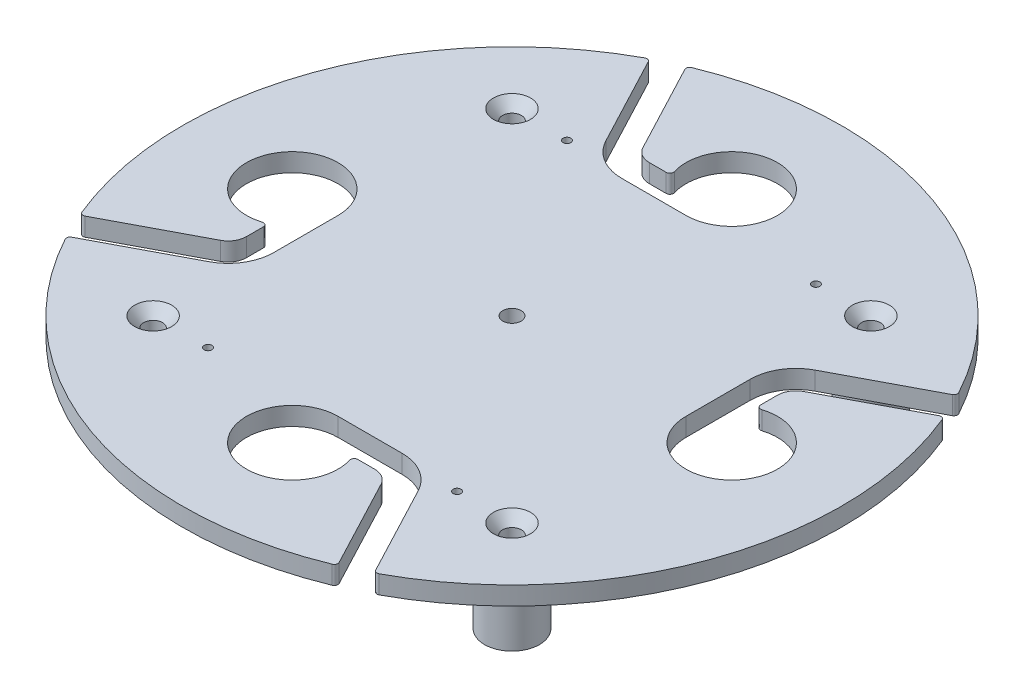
from build123d import *

# Parameters (mm, degrees)
SKETCH1_R                                     = 114.3
SKETCH1_R_2                                   = 3.175
BOSS_EXTRUDE1_DEPTH                           = 6.35
CUT_EXTRUDE1_DEPTH                            = 162.769287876
CIRPATTERN1_COUNT                             = 4
CSK_FOR_1_4_FLAT_HEAD_MACHINE_SCREW1_AT_COUNT = 2
CSK_FOR_1_4_FLAT_HEAD_MACHINE_SCREW1_AT_PITCH = 124.46
CSK_FOR_1_4_FLAT_HEAD_MACHINE_SCREW1_2_COUNT  = 2
CSK_FOR_1_4_FLAT_HEAD_MACHINE_SCREW1_2_PITCH  = 176.013019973
CSK_FOR_1_4_FLAT_HEAD_MACHINE_SCREW1_3_COUNT  = 2
CSK_FOR_1_4_FLAT_HEAD_MACHINE_SCREW1_3_PITCH  = 124.46
SKETCH5_R                                     = 9.525
SKETCH5_R_2                                   = 3.2639
BOSS_EXTRUDE2_DEPTH                           = 25.4
CIRPATTERN2_COUNT                             = 4
FILLET1_R                                     = 1.27
F_6_32_TAPPED_HOLE1_D                         = 2.7051


with BuildPart() as part:
    # Sketch1 → Boss-Extrude1 (new body)
    with BuildSketch(Plane(origin=(0, 0, 0), x_dir=(1, 0, 0), z_dir=(0, 1, 0))):
        with Locations(Location((0, 0, 0), (0, 0, 270))):
            Circle(SKETCH1_R)
        with Locations(Location((0, 0, 0), (0, 0, 270))):
            Circle(SKETCH1_R_2, mode=Mode.SUBTRACT)
    extrude(amount=BOSS_EXTRUDE1_DEPTH)

    # Sketch2 → Cut-Extrude1 (cut, through all)
    with BuildSketch(Plane(origin=(0, 6.35, 0), x_dir=(1, 0, 0), z_dir=(0, 1, 0))):
        with BuildLine():
            Line((102.996379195, 54.297314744), (105.80323487, 45.009495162))
            Line((105.80323487, 45.009495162), (73.238722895, 27.842235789))
            ThreePointArc((73.238722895, 27.842235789), (70.762785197, 25.505121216), (69.85, 22.225))
            Line((69.85, 22.225), (69.85, 16.375122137))
            ThreePointArc((69.85, 16.375122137), (70.366672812, 15.352675), (71.496296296, 15.162150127))
            ThreePointArc((71.496296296, 15.162150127), (85.616589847, 12.780589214), (92.075, 0))
            ThreePointArc((92.075, 0), (76.2, -15.875), (60.325, 0))
            Line((60.325, 0), (60.325, 22.225))
            ThreePointArc((60.325, 22.225), (62.606962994, 30.42530304), (68.796807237, 36.268089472))
            Line((68.796807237, 36.268089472), (102.996379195, 54.297314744))
        make_face()
    cut_extrude1 = extrude(amount=-CUT_EXTRUDE1_DEPTH, mode=Mode.SUBTRACT)

    # CirPattern1: Cut-Extrude1 ×4 about axis
    cirpattern1_axis = Axis((0, 0, 0), (0, 1, 0))
    for i in range(1, CIRPATTERN1_COUNT):
        add(cut_extrude1.rotate(cirpattern1_axis, i * 360 / CIRPATTERN1_COUNT), mode=Mode.SUBTRACT)

    # Sketch3 → CSK for 1_4 Flat Head Machine Screw1 (revolve, cut)
    with BuildSketch(Plane(origin=(-62.23, 6.35, -62.23), x_dir=(0, 0, 1), z_dir=(1, 0, 0))):
        Polygon((0, 0), (0, 6.35), (3.2639, 6.35), (3.2639, 3.652419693), (6.4389, 0), align=None)
    csk_for_1_4_flat_head_machine_screw1 = revolve(axis=Axis((-62.23, 12.7, -62.23), (0, -1, 0)), mode=Mode.SUBTRACT)

    # CSK for 1_4 Flat Head Machine Screw1 at: CSK for 1_4 Flat Head Machine Screw1 ×2
    with Locations(*[(i * CSK_FOR_1_4_FLAT_HEAD_MACHINE_SCREW1_AT_PITCH, 0, 0) for i in range(1, CSK_FOR_1_4_FLAT_HEAD_MACHINE_SCREW1_AT_COUNT)]):
        add(csk_for_1_4_flat_head_machine_screw1, mode=Mode.SUBTRACT)

    # CSK for 1_4 Flat Head Machine Screw1 2: CSK for 1_4 Flat Head Machine Screw1 ×2
    with Locations(*[Vector(0.7071067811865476, 0, 0.7071067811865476) * (i * CSK_FOR_1_4_FLAT_HEAD_MACHINE_SCREW1_2_PITCH) for i in range(1, CSK_FOR_1_4_FLAT_HEAD_MACHINE_SCREW1_2_COUNT)]):
        add(csk_for_1_4_flat_head_machine_screw1, mode=Mode.SUBTRACT)

    # CSK for 1_4 Flat Head Machine Screw1 3: CSK for 1_4 Flat Head Machine Screw1 ×2
    with Locations(*[(0, 0, i * CSK_FOR_1_4_FLAT_HEAD_MACHINE_SCREW1_3_PITCH) for i in range(1, CSK_FOR_1_4_FLAT_HEAD_MACHINE_SCREW1_3_COUNT)]):
        add(csk_for_1_4_flat_head_machine_screw1, mode=Mode.SUBTRACT)

    # Sketch5 → Boss-Extrude2 (add)
    with BuildSketch(Plane.XZ):
        with Locations(Location((62.23, 62.23, 0), (0, 0, 90))):
            Circle(SKETCH5_R)
        with Locations(Location((62.23, 62.23, 0), (0, 0, 90))):
            Circle(SKETCH5_R_2, mode=Mode.SUBTRACT)
    boss_extrude2 = extrude(amount=BOSS_EXTRUDE2_DEPTH)

    # CirPattern2: Boss-Extrude2 ×4 about axis
    cirpattern2_axis = Axis((0, 0, 0), (0, 1, 0))
    for i in range(1, CIRPATTERN2_COUNT):
        add(boss_extrude2.rotate(cirpattern2_axis, i * 360 / CIRPATTERN2_COUNT))

    # Fillet1
    fillet1_edges = [part.edges().sort_by_distance(p)[0] for p in [
        (105.200470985, 3.175, -44.691731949),
        (101.110244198, 3.175, -53.302987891),
        (-44.691731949, 3.175, -105.200470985),
        (-53.302987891, 3.175, -101.110244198),
        (44.691731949, 3.175, 105.200470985),
        (53.302987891, 3.175, 101.110244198),
        (-105.200470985, 3.175, 44.691731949),
        (-101.110244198, 3.175, 53.302987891),
    ]]
    fillet(fillet1_edges, radius=FILLET1_R)

    # 6-32 Tapped Hole1 (through all)
    with Locations(Plane(origin=(0, 6.35, 0), x_dir=(-1, 0, 0), z_dir=(0, 1, 0))):
        with Locations((43.18, -62.23), (-43.18, -62.23), (-43.18, 62.23), (43.18, 62.23)):
            Hole(F_6_32_TAPPED_HOLE1_D / 2)


solid = part.part
